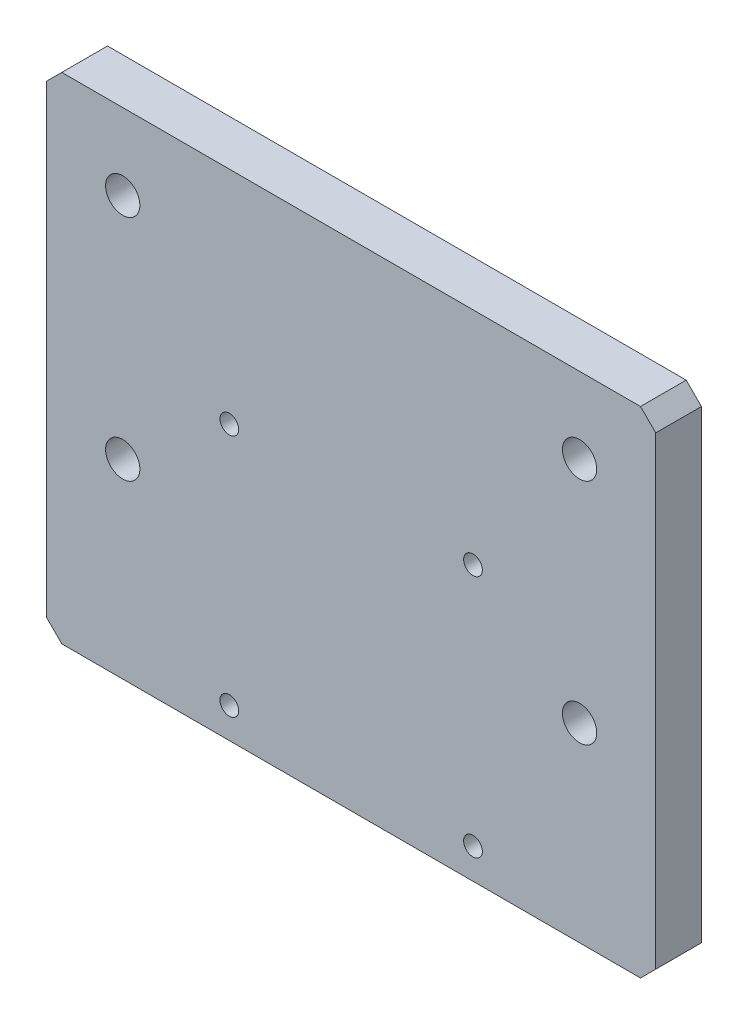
ISO-10303-21;
HEADER;
FILE_DESCRIPTION(('STEP AP214'),'2;1');
FILE_NAME('part.step','',(''),(''),'','','');
FILE_SCHEMA(('AUTOMOTIVE_DESIGN { 1 0 10303 214 1 1 1 1 }'));
ENDSEC;
DATA;
#1=APPLICATION_CONTEXT('core data for automotive mechanical design processes');
#2=APPLICATION_PROTOCOL_DEFINITION('international standard','automotive_design',2000,#1);
#3=PRODUCT_CONTEXT('',#1,'mechanical');
#4=PRODUCT('Part','Part','',(#3));
#5=PRODUCT_RELATED_PRODUCT_CATEGORY('part','',(#4));
#6=PRODUCT_DEFINITION_FORMATION('','',#4);
#7=PRODUCT_DEFINITION_CONTEXT('part definition',#1,'design');
#8=PRODUCT_DEFINITION('design','',#6,#7);
#9=PRODUCT_DEFINITION_SHAPE('','',#8);
#10=(LENGTH_UNIT() NAMED_UNIT(*) SI_UNIT(.MILLI.,.METRE.));
#11=(NAMED_UNIT(*) PLANE_ANGLE_UNIT() SI_UNIT($,.RADIAN.));
#12=(NAMED_UNIT(*) SI_UNIT($,.STERADIAN.) SOLID_ANGLE_UNIT());
#13=UNCERTAINTY_MEASURE_WITH_UNIT(LENGTH_MEASURE(1.E-05),#10,'distance_accuracy_value','');
#14=(GEOMETRIC_REPRESENTATION_CONTEXT(3) GLOBAL_UNCERTAINTY_ASSIGNED_CONTEXT((#13)) GLOBAL_UNIT_ASSIGNED_CONTEXT((#10,
#11,#12)) REPRESENTATION_CONTEXT('',''));
#15=CARTESIAN_POINT('',(0.,0.,0.));
#16=DIRECTION('',(0.,0.,1.));
#17=DIRECTION('',(1.,0.,0.));
#18=AXIS2_PLACEMENT_3D('',#15,#16,#17);
#19=CARTESIAN_POINT('',(0.,0.,6.));
#20=DIRECTION('',(1.,0.,0.));
#21=DIRECTION('',(0.,0.,-1.));
#22=AXIS2_PLACEMENT_3D('',#19,#20,#21);
#23=PLANE('',#22);
#24=DIRECTION('',(0.,-1.,0.));
#25=VECTOR('',#24,1.);
#26=CARTESIAN_POINT('',(0.,0.,0.));
#27=LINE('',#26,#25);
#28=CARTESIAN_POINT('',(0.,63.,0.));
#29=VERTEX_POINT('',#28);
#30=CARTESIAN_POINT('',(0.,2.00000000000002,0.));
#31=VERTEX_POINT('',#30);
#32=EDGE_CURVE('E129',#29,#31,#27,.T.);
#33=ORIENTED_EDGE('',*,*,#32,.T.);
#34=DIRECTION('',(0.,0.,1.));
#35=VECTOR('',#34,1.);
#36=CARTESIAN_POINT('',(0.,2.00000000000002,6.));
#37=LINE('',#36,#35);
#38=CARTESIAN_POINT('',(0.,2.00000000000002,6.));
#39=VERTEX_POINT('',#38);
#40=EDGE_CURVE('E11',#31,#39,#37,.T.);
#41=ORIENTED_EDGE('',*,*,#40,.T.);
#42=DIRECTION('',(0.,-1.,0.));
#43=VECTOR('',#42,1.);
#44=CARTESIAN_POINT('',(0.,0.,6.));
#45=LINE('',#44,#43);
#46=CARTESIAN_POINT('',(0.,63.,6.));
#47=VERTEX_POINT('',#46);
#48=EDGE_CURVE('E148',#47,#39,#45,.T.);
#49=ORIENTED_EDGE('',*,*,#48,.F.);
#50=DIRECTION('',(0.,0.,-1.));
#51=VECTOR('',#50,1.);
#52=CARTESIAN_POINT('',(0.,63.,6.));
#53=LINE('',#52,#51);
#54=EDGE_CURVE('E49',#47,#29,#53,.T.);
#55=ORIENTED_EDGE('',*,*,#54,.T.);
#56=EDGE_LOOP('',(#33,#41,#49,#55));
#57=FACE_BOUND('',#56,.T.);
#58=ADVANCED_FACE('F41',(#57),#23,.F.);
#59=CARTESIAN_POINT('',(0.,0.,6.));
#60=DIRECTION('',(0.,1.,0.));
#61=DIRECTION('',(0.,0.,1.));
#62=AXIS2_PLACEMENT_3D('',#59,#60,#61);
#63=PLANE('',#62);
#64=DIRECTION('',(1.,0.,0.));
#65=VECTOR('',#64,1.);
#66=CARTESIAN_POINT('',(0.,0.,0.));
#67=LINE('',#66,#65);
#68=CARTESIAN_POINT('',(2.00000000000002,0.,0.));
#69=VERTEX_POINT('',#68);
#70=CARTESIAN_POINT('',(78.,0.,0.));
#71=VERTEX_POINT('',#70);
#72=EDGE_CURVE('E113',#69,#71,#67,.T.);
#73=ORIENTED_EDGE('',*,*,#72,.T.);
#74=DIRECTION('',(0.,0.,1.));
#75=VECTOR('',#74,1.);
#76=CARTESIAN_POINT('',(78.,0.,6.));
#77=LINE('',#76,#75);
#78=CARTESIAN_POINT('',(78.,0.,6.));
#79=VERTEX_POINT('',#78);
#80=EDGE_CURVE('E119',#71,#79,#77,.T.);
#81=ORIENTED_EDGE('',*,*,#80,.T.);
#82=DIRECTION('',(1.,0.,0.));
#83=VECTOR('',#82,1.);
#84=CARTESIAN_POINT('',(0.,0.,6.));
#85=LINE('',#84,#83);
#86=CARTESIAN_POINT('',(2.00000000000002,0.,6.));
#87=VERTEX_POINT('',#86);
#88=EDGE_CURVE('E116',#87,#79,#85,.T.);
#89=ORIENTED_EDGE('',*,*,#88,.F.);
#90=DIRECTION('',(0.,0.,-1.));
#91=VECTOR('',#90,1.);
#92=CARTESIAN_POINT('',(2.00000000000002,0.,6.));
#93=LINE('',#92,#91);
#94=EDGE_CURVE('E109',#87,#69,#93,.T.);
#95=ORIENTED_EDGE('',*,*,#94,.T.);
#96=EDGE_LOOP('',(#73,#81,#89,#95));
#97=FACE_BOUND('',#96,.T.);
#98=ADVANCED_FACE('F111',(#97),#63,.F.);
#99=CARTESIAN_POINT('',(80.,0.,6.));
#100=DIRECTION('',(-1.,0.,0.));
#101=DIRECTION('',(0.,0.,1.));
#102=AXIS2_PLACEMENT_3D('',#99,#100,#101);
#103=PLANE('',#102);
#104=DIRECTION('',(0.,1.,0.));
#105=VECTOR('',#104,1.);
#106=CARTESIAN_POINT('',(80.,0.,6.));
#107=LINE('',#106,#105);
#108=CARTESIAN_POINT('',(80.,1.99999999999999,6.));
#109=VERTEX_POINT('',#108);
#110=CARTESIAN_POINT('',(80.,63.,6.));
#111=VERTEX_POINT('',#110);
#112=EDGE_CURVE('E161',#109,#111,#107,.T.);
#113=ORIENTED_EDGE('',*,*,#112,.F.);
#114=DIRECTION('',(0.,0.,-1.));
#115=VECTOR('',#114,1.);
#116=CARTESIAN_POINT('',(80.,1.99999999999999,6.));
#117=LINE('',#116,#115);
#118=CARTESIAN_POINT('',(80.,1.99999999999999,0.));
#119=VERTEX_POINT('',#118);
#120=EDGE_CURVE('E136',#109,#119,#117,.T.);
#121=ORIENTED_EDGE('',*,*,#120,.T.);
#122=DIRECTION('',(0.,1.,0.));
#123=VECTOR('',#122,1.);
#124=CARTESIAN_POINT('',(80.,0.,0.));
#125=LINE('',#124,#123);
#126=CARTESIAN_POINT('',(80.,63.,0.));
#127=VERTEX_POINT('',#126);
#128=EDGE_CURVE('E128',#119,#127,#125,.T.);
#129=ORIENTED_EDGE('',*,*,#128,.T.);
#130=DIRECTION('',(0.,0.,1.));
#131=VECTOR('',#130,1.);
#132=CARTESIAN_POINT('',(80.,63.,6.));
#133=LINE('',#132,#131);
#134=EDGE_CURVE('E181',#127,#111,#133,.T.);
#135=ORIENTED_EDGE('',*,*,#134,.T.);
#136=EDGE_LOOP('',(#113,#121,#129,#135));
#137=FACE_BOUND('',#136,.T.);
#138=ADVANCED_FACE('F186',(#137),#103,.F.);
#139=CARTESIAN_POINT('',(0.,65.,6.));
#140=DIRECTION('',(0.,-1.,0.));
#141=DIRECTION('',(0.,0.,-1.));
#142=AXIS2_PLACEMENT_3D('',#139,#140,#141);
#143=PLANE('',#142);
#144=DIRECTION('',(-1.,0.,0.));
#145=VECTOR('',#144,1.);
#146=CARTESIAN_POINT('',(0.,65.,6.));
#147=LINE('',#146,#145);
#148=CARTESIAN_POINT('',(78.,65.,6.));
#149=VERTEX_POINT('',#148);
#150=CARTESIAN_POINT('',(2.00000000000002,65.,6.));
#151=VERTEX_POINT('',#150);
#152=EDGE_CURVE('E120',#149,#151,#147,.T.);
#153=ORIENTED_EDGE('',*,*,#152,.F.);
#154=DIRECTION('',(0.,0.,-1.));
#155=VECTOR('',#154,1.);
#156=CARTESIAN_POINT('',(78.,65.,6.));
#157=LINE('',#156,#155);
#158=CARTESIAN_POINT('',(78.,65.,0.));
#159=VERTEX_POINT('',#158);
#160=EDGE_CURVE('E63',#149,#159,#157,.T.);
#161=ORIENTED_EDGE('',*,*,#160,.T.);
#162=DIRECTION('',(-1.,0.,0.));
#163=VECTOR('',#162,1.);
#164=CARTESIAN_POINT('',(0.,65.,0.));
#165=LINE('',#164,#163);
#166=CARTESIAN_POINT('',(2.00000000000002,65.,0.));
#167=VERTEX_POINT('',#166);
#168=EDGE_CURVE('E156',#159,#167,#165,.T.);
#169=ORIENTED_EDGE('',*,*,#168,.T.);
#170=DIRECTION('',(0.,0.,1.));
#171=VECTOR('',#170,1.);
#172=CARTESIAN_POINT('',(2.00000000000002,65.,6.));
#173=LINE('',#172,#171);
#174=EDGE_CURVE('E141',#167,#151,#173,.T.);
#175=ORIENTED_EDGE('',*,*,#174,.T.);
#176=EDGE_LOOP('',(#153,#161,#169,#175));
#177=FACE_BOUND('',#176,.T.);
#178=ADVANCED_FACE('F155',(#177),#143,.F.);
#179=CARTESIAN_POINT('',(0.,0.,6.));
#180=DIRECTION('',(0.,0.,-1.));
#181=DIRECTION('',(-1.,0.,0.));
#182=AXIS2_PLACEMENT_3D('',#179,#180,#181);
#183=PLANE('',#182);
#184=CARTESIAN_POINT('',(56.,36.,6.));
#185=DIRECTION('',(0.,0.,1.));
#186=DIRECTION('',(1.,0.,0.));
#187=AXIS2_PLACEMENT_3D('',#184,#185,#186);
#188=CIRCLE('',#187,1.2295);
#189=CARTESIAN_POINT('',(57.2295,36.,6.));
#190=VERTEX_POINT('',#189);
#191=EDGE_CURVE('E232',#190,#190,#188,.T.);
#192=ORIENTED_EDGE('',*,*,#191,.F.);
#193=EDGE_LOOP('',(#192));
#194=FACE_BOUND('',#193,.T.);
#195=CARTESIAN_POINT('',(56.,4.,6.));
#196=DIRECTION('',(0.,0.,1.));
#197=DIRECTION('',(1.,0.,0.));
#198=AXIS2_PLACEMENT_3D('',#195,#196,#197);
#199=CIRCLE('',#198,1.2295);
#200=CARTESIAN_POINT('',(57.2295,4.,6.));
#201=VERTEX_POINT('',#200);
#202=EDGE_CURVE('E226',#201,#201,#199,.T.);
#203=ORIENTED_EDGE('',*,*,#202,.F.);
#204=EDGE_LOOP('',(#203));
#205=FACE_BOUND('',#204,.T.);
#206=CARTESIAN_POINT('',(24.,36.,6.));
#207=DIRECTION('',(0.,0.,1.));
#208=DIRECTION('',(1.,0.,0.));
#209=AXIS2_PLACEMENT_3D('',#206,#207,#208);
#210=CIRCLE('',#209,1.2295);
#211=CARTESIAN_POINT('',(25.2295,36.,6.));
#212=VERTEX_POINT('',#211);
#213=EDGE_CURVE('E220',#212,#212,#210,.T.);
#214=ORIENTED_EDGE('',*,*,#213,.F.);
#215=EDGE_LOOP('',(#214));
#216=FACE_BOUND('',#215,.T.);
#217=CARTESIAN_POINT('',(24.,4.,6.));
#218=DIRECTION('',(0.,0.,1.));
#219=DIRECTION('',(1.,0.,0.));
#220=AXIS2_PLACEMENT_3D('',#217,#218,#219);
#221=CIRCLE('',#220,1.2295);
#222=CARTESIAN_POINT('',(25.2295,4.,6.));
#223=VERTEX_POINT('',#222);
#224=EDGE_CURVE('E172',#223,#223,#221,.T.);
#225=ORIENTED_EDGE('',*,*,#224,.F.);
#226=EDGE_LOOP('',(#225));
#227=FACE_BOUND('',#226,.T.);
#228=CARTESIAN_POINT('',(70.,55.,6.));
#229=DIRECTION('',(0.,0.,1.));
#230=DIRECTION('',(1.,0.,0.));
#231=AXIS2_PLACEMENT_3D('',#228,#229,#230);
#232=CIRCLE('',#231,2.25);
#233=CARTESIAN_POINT('',(72.25,55.,6.));
#234=VERTEX_POINT('',#233);
#235=EDGE_CURVE('E171',#234,#234,#232,.T.);
#236=ORIENTED_EDGE('',*,*,#235,.F.);
#237=EDGE_LOOP('',(#236));
#238=FACE_BOUND('',#237,.T.);
#239=CARTESIAN_POINT('',(70.,25.,6.));
#240=DIRECTION('',(0.,0.,1.));
#241=DIRECTION('',(1.,0.,0.));
#242=AXIS2_PLACEMENT_3D('',#239,#240,#241);
#243=CIRCLE('',#242,2.25);
#244=CARTESIAN_POINT('',(72.25,25.,6.));
#245=VERTEX_POINT('',#244);
#246=EDGE_CURVE('E207',#245,#245,#243,.T.);
#247=ORIENTED_EDGE('',*,*,#246,.F.);
#248=EDGE_LOOP('',(#247));
#249=FACE_BOUND('',#248,.T.);
#250=CARTESIAN_POINT('',(10.,55.,6.));
#251=DIRECTION('',(0.,0.,1.));
#252=DIRECTION('',(1.,0.,0.));
#253=AXIS2_PLACEMENT_3D('',#250,#251,#252);
#254=CIRCLE('',#253,2.25);
#255=CARTESIAN_POINT('',(12.25,55.,6.));
#256=VERTEX_POINT('',#255);
#257=EDGE_CURVE('E201',#256,#256,#254,.T.);
#258=ORIENTED_EDGE('',*,*,#257,.F.);
#259=EDGE_LOOP('',(#258));
#260=FACE_BOUND('',#259,.T.);
#261=CARTESIAN_POINT('',(10.,25.,6.));
#262=DIRECTION('',(0.,0.,1.));
#263=DIRECTION('',(1.,0.,0.));
#264=AXIS2_PLACEMENT_3D('',#261,#262,#263);
#265=CIRCLE('',#264,2.25);
#266=CARTESIAN_POINT('',(12.25,25.,6.));
#267=VERTEX_POINT('',#266);
#268=EDGE_CURVE('E195',#267,#267,#265,.T.);
#269=ORIENTED_EDGE('',*,*,#268,.F.);
#270=EDGE_LOOP('',(#269));
#271=FACE_BOUND('',#270,.T.);
#272=ORIENTED_EDGE('',*,*,#88,.T.);
#273=DIRECTION('',(-0.707106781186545,-0.70710678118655,0.));
#274=VECTOR('',#273,1.);
#275=CARTESIAN_POINT('',(78.,0.,6.));
#276=LINE('',#275,#274);
#277=EDGE_CURVE('E179',#79,#109,#276,.F.);
#278=ORIENTED_EDGE('',*,*,#277,.T.);
#279=ORIENTED_EDGE('',*,*,#112,.T.);
#280=DIRECTION('',(0.707106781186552,-0.707106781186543,0.));
#281=VECTOR('',#280,1.);
#282=CARTESIAN_POINT('',(80.,63.,6.));
#283=LINE('',#282,#281);
#284=EDGE_CURVE('E160',#111,#149,#283,.F.);
#285=ORIENTED_EDGE('',*,*,#284,.T.);
#286=ORIENTED_EDGE('',*,*,#152,.T.);
#287=DIRECTION('',(0.707106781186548,0.707106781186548,0.));
#288=VECTOR('',#287,1.);
#289=CARTESIAN_POINT('',(2.00000000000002,65.,6.));
#290=LINE('',#289,#288);
#291=EDGE_CURVE('E153',#151,#47,#290,.F.);
#292=ORIENTED_EDGE('',*,*,#291,.T.);
#293=ORIENTED_EDGE('',*,*,#48,.T.);
#294=DIRECTION('',(-0.707106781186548,0.707106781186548,0.));
#295=VECTOR('',#294,1.);
#296=CARTESIAN_POINT('',(0.,2.00000000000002,6.));
#297=LINE('',#296,#295);
#298=EDGE_CURVE('E176',#39,#87,#297,.F.);
#299=ORIENTED_EDGE('',*,*,#298,.T.);
#300=EDGE_LOOP('',(#272,#278,#279,#285,#286,#292,#293,#299));
#301=FACE_BOUND('',#300,.T.);
#302=ADVANCED_FACE('F158',(#194,#205,#216,#227,#238,#249,#260,#271,#301),#183,.F.);
#303=CARTESIAN_POINT('',(0.,0.,0.));
#304=DIRECTION('',(0.,0.,-1.));
#305=DIRECTION('',(-1.,0.,0.));
#306=AXIS2_PLACEMENT_3D('',#303,#304,#305);
#307=PLANE('',#306);
#308=CARTESIAN_POINT('',(56.,36.,0.));
#309=DIRECTION('',(0.,0.,-1.));
#310=DIRECTION('',(-1.,0.,0.));
#311=AXIS2_PLACEMENT_3D('',#308,#309,#310);
#312=CIRCLE('',#311,1.2295);
#313=CARTESIAN_POINT('',(54.7705,36.,0.));
#314=VERTEX_POINT('',#313);
#315=EDGE_CURVE('E229',#314,#314,#312,.T.);
#316=ORIENTED_EDGE('',*,*,#315,.F.);
#317=EDGE_LOOP('',(#316));
#318=FACE_BOUND('',#317,.T.);
#319=CARTESIAN_POINT('',(56.,4.,0.));
#320=DIRECTION('',(0.,0.,-1.));
#321=DIRECTION('',(-1.,0.,0.));
#322=AXIS2_PLACEMENT_3D('',#319,#320,#321);
#323=CIRCLE('',#322,1.2295);
#324=CARTESIAN_POINT('',(54.7705,4.,0.));
#325=VERTEX_POINT('',#324);
#326=EDGE_CURVE('E223',#325,#325,#323,.T.);
#327=ORIENTED_EDGE('',*,*,#326,.F.);
#328=EDGE_LOOP('',(#327));
#329=FACE_BOUND('',#328,.T.);
#330=CARTESIAN_POINT('',(24.,36.,0.));
#331=DIRECTION('',(0.,0.,-1.));
#332=DIRECTION('',(-1.,0.,0.));
#333=AXIS2_PLACEMENT_3D('',#330,#331,#332);
#334=CIRCLE('',#333,1.2295);
#335=CARTESIAN_POINT('',(22.7705,36.,0.));
#336=VERTEX_POINT('',#335);
#337=EDGE_CURVE('E217',#336,#336,#334,.T.);
#338=ORIENTED_EDGE('',*,*,#337,.F.);
#339=EDGE_LOOP('',(#338));
#340=FACE_BOUND('',#339,.T.);
#341=CARTESIAN_POINT('',(24.,4.,0.));
#342=DIRECTION('',(0.,0.,-1.));
#343=DIRECTION('',(-1.,0.,0.));
#344=AXIS2_PLACEMENT_3D('',#341,#342,#343);
#345=CIRCLE('',#344,1.2295);
#346=CARTESIAN_POINT('',(22.7705,4.,0.));
#347=VERTEX_POINT('',#346);
#348=EDGE_CURVE('E169',#347,#347,#345,.T.);
#349=ORIENTED_EDGE('',*,*,#348,.F.);
#350=EDGE_LOOP('',(#349));
#351=FACE_BOUND('',#350,.T.);
#352=CARTESIAN_POINT('',(70.,55.,0.));
#353=DIRECTION('',(0.,0.,1.));
#354=DIRECTION('',(1.,0.,0.));
#355=AXIS2_PLACEMENT_3D('',#352,#353,#354);
#356=CIRCLE('',#355,2.25);
#357=CARTESIAN_POINT('',(72.25,55.,0.));
#358=VERTEX_POINT('',#357);
#359=EDGE_CURVE('E210',#358,#358,#356,.T.);
#360=ORIENTED_EDGE('',*,*,#359,.T.);
#361=EDGE_LOOP('',(#360));
#362=FACE_BOUND('',#361,.T.);
#363=CARTESIAN_POINT('',(70.,25.,0.));
#364=DIRECTION('',(0.,0.,1.));
#365=DIRECTION('',(1.,0.,0.));
#366=AXIS2_PLACEMENT_3D('',#363,#364,#365);
#367=CIRCLE('',#366,2.25);
#368=CARTESIAN_POINT('',(72.25,25.,0.));
#369=VERTEX_POINT('',#368);
#370=EDGE_CURVE('E204',#369,#369,#367,.T.);
#371=ORIENTED_EDGE('',*,*,#370,.T.);
#372=EDGE_LOOP('',(#371));
#373=FACE_BOUND('',#372,.T.);
#374=CARTESIAN_POINT('',(10.,55.,0.));
#375=DIRECTION('',(0.,0.,1.));
#376=DIRECTION('',(1.,0.,0.));
#377=AXIS2_PLACEMENT_3D('',#374,#375,#376);
#378=CIRCLE('',#377,2.25);
#379=CARTESIAN_POINT('',(12.25,55.,0.));
#380=VERTEX_POINT('',#379);
#381=EDGE_CURVE('E198',#380,#380,#378,.T.);
#382=ORIENTED_EDGE('',*,*,#381,.T.);
#383=EDGE_LOOP('',(#382));
#384=FACE_BOUND('',#383,.T.);
#385=CARTESIAN_POINT('',(10.,25.,0.));
#386=DIRECTION('',(0.,0.,1.));
#387=DIRECTION('',(1.,0.,0.));
#388=AXIS2_PLACEMENT_3D('',#385,#386,#387);
#389=CIRCLE('',#388,2.25);
#390=CARTESIAN_POINT('',(12.25,25.,0.));
#391=VERTEX_POINT('',#390);
#392=EDGE_CURVE('E150',#391,#391,#389,.T.);
#393=ORIENTED_EDGE('',*,*,#392,.T.);
#394=EDGE_LOOP('',(#393));
#395=FACE_BOUND('',#394,.T.);
#396=ORIENTED_EDGE('',*,*,#128,.F.);
#397=DIRECTION('',(0.707106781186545,0.70710678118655,0.));
#398=VECTOR('',#397,1.);
#399=CARTESIAN_POINT('',(39.0000000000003,-39.,0.));
#400=LINE('',#399,#398);
#401=EDGE_CURVE('E127',#119,#71,#400,.F.);
#402=ORIENTED_EDGE('',*,*,#401,.T.);
#403=ORIENTED_EDGE('',*,*,#72,.F.);
#404=DIRECTION('',(0.707106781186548,-0.707106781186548,0.));
#405=VECTOR('',#404,1.);
#406=CARTESIAN_POINT('',(1.00000000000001,1.00000000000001,0.));
#407=LINE('',#406,#405);
#408=EDGE_CURVE('E124',#69,#31,#407,.F.);
#409=ORIENTED_EDGE('',*,*,#408,.T.);
#410=ORIENTED_EDGE('',*,*,#32,.F.);
#411=DIRECTION('',(-0.707106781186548,-0.707106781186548,0.));
#412=VECTOR('',#411,1.);
#413=CARTESIAN_POINT('',(-31.5,31.5,0.));
#414=LINE('',#413,#412);
#415=EDGE_CURVE('E56',#29,#167,#414,.F.);
#416=ORIENTED_EDGE('',*,*,#415,.T.);
#417=ORIENTED_EDGE('',*,*,#168,.F.);
#418=DIRECTION('',(-0.707106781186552,0.707106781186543,0.));
#419=VECTOR('',#418,1.);
#420=CARTESIAN_POINT('',(71.4999999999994,71.5000000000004,0.));
#421=LINE('',#420,#419);
#422=EDGE_CURVE('E133',#159,#127,#421,.F.);
#423=ORIENTED_EDGE('',*,*,#422,.T.);
#424=EDGE_LOOP('',(#396,#402,#403,#409,#410,#416,#417,#423));
#425=FACE_BOUND('',#424,.T.);
#426=ADVANCED_FACE('F123',(#318,#329,#340,#351,#362,#373,#384,#395,#425),#307,.T.);
#427=CARTESIAN_POINT('',(10.,25.,6.));
#428=DIRECTION('',(0.,0.,1.));
#429=DIRECTION('',(1.,0.,0.));
#430=AXIS2_PLACEMENT_3D('',#427,#428,#429);
#431=CYLINDRICAL_SURFACE('',#430,2.25);
#432=ORIENTED_EDGE('',*,*,#392,.F.);
#433=EDGE_LOOP('',(#432));
#434=FACE_BOUND('',#433,.T.);
#435=ORIENTED_EDGE('',*,*,#268,.T.);
#436=EDGE_LOOP('',(#435));
#437=FACE_BOUND('',#436,.T.);
#438=ADVANCED_FACE('F255',(#434,#437),#431,.F.);
#439=CARTESIAN_POINT('',(10.,55.,6.));
#440=DIRECTION('',(0.,0.,1.));
#441=DIRECTION('',(1.,0.,0.));
#442=AXIS2_PLACEMENT_3D('',#439,#440,#441);
#443=CYLINDRICAL_SURFACE('',#442,2.25);
#444=ORIENTED_EDGE('',*,*,#381,.F.);
#445=EDGE_LOOP('',(#444));
#446=FACE_BOUND('',#445,.T.);
#447=ORIENTED_EDGE('',*,*,#257,.T.);
#448=EDGE_LOOP('',(#447));
#449=FACE_BOUND('',#448,.T.);
#450=ADVANCED_FACE('F257',(#446,#449),#443,.F.);
#451=CARTESIAN_POINT('',(70.,25.,6.));
#452=DIRECTION('',(0.,0.,1.));
#453=DIRECTION('',(1.,0.,0.));
#454=AXIS2_PLACEMENT_3D('',#451,#452,#453);
#455=CYLINDRICAL_SURFACE('',#454,2.25);
#456=ORIENTED_EDGE('',*,*,#370,.F.);
#457=EDGE_LOOP('',(#456));
#458=FACE_BOUND('',#457,.T.);
#459=ORIENTED_EDGE('',*,*,#246,.T.);
#460=EDGE_LOOP('',(#459));
#461=FACE_BOUND('',#460,.T.);
#462=ADVANCED_FACE('F264',(#458,#461),#455,.F.);
#463=CARTESIAN_POINT('',(70.,55.,6.));
#464=DIRECTION('',(0.,0.,1.));
#465=DIRECTION('',(1.,0.,0.));
#466=AXIS2_PLACEMENT_3D('',#463,#464,#465);
#467=CYLINDRICAL_SURFACE('',#466,2.25);
#468=ORIENTED_EDGE('',*,*,#359,.F.);
#469=EDGE_LOOP('',(#468));
#470=FACE_BOUND('',#469,.T.);
#471=ORIENTED_EDGE('',*,*,#235,.T.);
#472=EDGE_LOOP('',(#471));
#473=FACE_BOUND('',#472,.T.);
#474=ADVANCED_FACE('F386',(#470,#473),#467,.F.);
#475=CARTESIAN_POINT('',(24.,4.,6.));
#476=DIRECTION('',(0.,0.,1.));
#477=DIRECTION('',(1.,0.,0.));
#478=AXIS2_PLACEMENT_3D('',#475,#476,#477);
#479=CYLINDRICAL_SURFACE('',#478,1.2295);
#480=ORIENTED_EDGE('',*,*,#348,.T.);
#481=EDGE_LOOP('',(#480));
#482=FACE_BOUND('',#481,.T.);
#483=ORIENTED_EDGE('',*,*,#224,.T.);
#484=EDGE_LOOP('',(#483));
#485=FACE_BOUND('',#484,.T.);
#486=ADVANCED_FACE('F375',(#482,#485),#479,.F.);
#487=CARTESIAN_POINT('',(24.,36.,6.));
#488=DIRECTION('',(0.,0.,1.));
#489=DIRECTION('',(1.,0.,0.));
#490=AXIS2_PLACEMENT_3D('',#487,#488,#489);
#491=CYLINDRICAL_SURFACE('',#490,1.2295);
#492=ORIENTED_EDGE('',*,*,#337,.T.);
#493=EDGE_LOOP('',(#492));
#494=FACE_BOUND('',#493,.T.);
#495=ORIENTED_EDGE('',*,*,#213,.T.);
#496=EDGE_LOOP('',(#495));
#497=FACE_BOUND('',#496,.T.);
#498=ADVANCED_FACE('F364',(#494,#497),#491,.F.);
#499=CARTESIAN_POINT('',(56.,4.,6.));
#500=DIRECTION('',(0.,0.,1.));
#501=DIRECTION('',(1.,0.,0.));
#502=AXIS2_PLACEMENT_3D('',#499,#500,#501);
#503=CYLINDRICAL_SURFACE('',#502,1.2295);
#504=ORIENTED_EDGE('',*,*,#326,.T.);
#505=EDGE_LOOP('',(#504));
#506=FACE_BOUND('',#505,.T.);
#507=ORIENTED_EDGE('',*,*,#202,.T.);
#508=EDGE_LOOP('',(#507));
#509=FACE_BOUND('',#508,.T.);
#510=ADVANCED_FACE('F353',(#506,#509),#503,.F.);
#511=CARTESIAN_POINT('',(56.,36.,6.));
#512=DIRECTION('',(0.,0.,1.));
#513=DIRECTION('',(1.,0.,0.));
#514=AXIS2_PLACEMENT_3D('',#511,#512,#513);
#515=CYLINDRICAL_SURFACE('',#514,1.2295);
#516=ORIENTED_EDGE('',*,*,#315,.T.);
#517=EDGE_LOOP('',(#516));
#518=FACE_BOUND('',#517,.T.);
#519=ORIENTED_EDGE('',*,*,#191,.T.);
#520=EDGE_LOOP('',(#519));
#521=FACE_BOUND('',#520,.T.);
#522=ADVANCED_FACE('F236',(#518,#521),#515,.F.);
#523=CARTESIAN_POINT('',(78.,0.,6.));
#524=DIRECTION('',(-0.70710678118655,0.707106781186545,0.));
#525=DIRECTION('',(0.,0.,1.));
#526=AXIS2_PLACEMENT_3D('',#523,#524,#525);
#527=PLANE('',#526);
#528=ORIENTED_EDGE('',*,*,#401,.F.);
#529=ORIENTED_EDGE('',*,*,#120,.F.);
#530=ORIENTED_EDGE('',*,*,#277,.F.);
#531=ORIENTED_EDGE('',*,*,#80,.F.);
#532=EDGE_LOOP('',(#528,#529,#530,#531));
#533=FACE_BOUND('',#532,.T.);
#534=ADVANCED_FACE('F190',(#533),#527,.F.);
#535=CARTESIAN_POINT('',(80.,63.,6.));
#536=DIRECTION('',(-0.707106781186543,-0.707106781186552,0.));
#537=DIRECTION('',(0.,0.,1.));
#538=AXIS2_PLACEMENT_3D('',#535,#536,#537);
#539=PLANE('',#538);
#540=ORIENTED_EDGE('',*,*,#422,.F.);
#541=ORIENTED_EDGE('',*,*,#160,.F.);
#542=ORIENTED_EDGE('',*,*,#284,.F.);
#543=ORIENTED_EDGE('',*,*,#134,.F.);
#544=EDGE_LOOP('',(#540,#541,#542,#543));
#545=FACE_BOUND('',#544,.T.);
#546=ADVANCED_FACE('F280',(#545),#539,.F.);
#547=CARTESIAN_POINT('',(0.,2.00000000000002,6.));
#548=DIRECTION('',(0.707106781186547,0.707106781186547,0.));
#549=DIRECTION('',(0.,0.,1.));
#550=AXIS2_PLACEMENT_3D('',#547,#548,#549);
#551=PLANE('',#550);
#552=ORIENTED_EDGE('',*,*,#408,.F.);
#553=ORIENTED_EDGE('',*,*,#94,.F.);
#554=ORIENTED_EDGE('',*,*,#298,.F.);
#555=ORIENTED_EDGE('',*,*,#40,.F.);
#556=EDGE_LOOP('',(#552,#553,#554,#555));
#557=FACE_BOUND('',#556,.T.);
#558=ADVANCED_FACE('F132',(#557),#551,.F.);
#559=CARTESIAN_POINT('',(2.00000000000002,65.,6.));
#560=DIRECTION('',(0.707106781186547,-0.707106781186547,0.));
#561=DIRECTION('',(0.,0.,1.));
#562=AXIS2_PLACEMENT_3D('',#559,#560,#561);
#563=PLANE('',#562);
#564=ORIENTED_EDGE('',*,*,#415,.F.);
#565=ORIENTED_EDGE('',*,*,#54,.F.);
#566=ORIENTED_EDGE('',*,*,#291,.F.);
#567=ORIENTED_EDGE('',*,*,#174,.F.);
#568=EDGE_LOOP('',(#564,#565,#566,#567));
#569=FACE_BOUND('',#568,.T.);
#570=ADVANCED_FACE('F43',(#569),#563,.F.);
#571=CLOSED_SHELL('',(#58,#98,#138,#178,#302,#426,#438,#450,#462,#474,#486,#498,#510,#522,#534,
#546,#558,#570));
#572=MANIFOLD_SOLID_BREP('B2',#571);
#573=ADVANCED_BREP_SHAPE_REPRESENTATION('',(#18,#572),#14);
#574=SHAPE_DEFINITION_REPRESENTATION(#9,#573);
ENDSEC;
END-ISO-10303-21;
